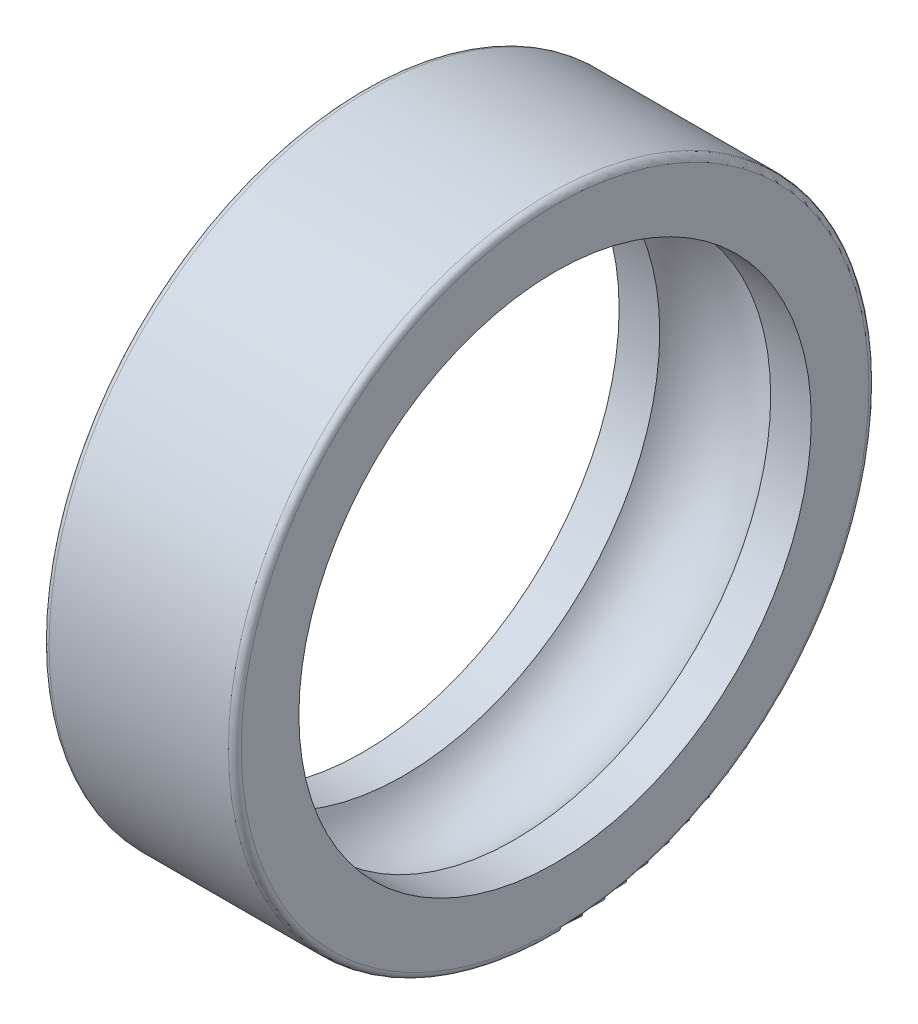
ISO-10303-21;
HEADER;
FILE_DESCRIPTION(('STEP AP214'),'2;1');
FILE_NAME('part.step','',(''),(''),'','','');
FILE_SCHEMA(('AUTOMOTIVE_DESIGN { 1 0 10303 214 1 1 1 1 }'));
ENDSEC;
DATA;
#1=APPLICATION_CONTEXT('core data for automotive mechanical design processes');
#2=APPLICATION_PROTOCOL_DEFINITION('international standard','automotive_design',2000,#1);
#3=PRODUCT_CONTEXT('',#1,'mechanical');
#4=PRODUCT('Part','Part','',(#3));
#5=PRODUCT_RELATED_PRODUCT_CATEGORY('part','',(#4));
#6=PRODUCT_DEFINITION_FORMATION('','',#4);
#7=PRODUCT_DEFINITION_CONTEXT('part definition',#1,'design');
#8=PRODUCT_DEFINITION('design','',#6,#7);
#9=PRODUCT_DEFINITION_SHAPE('','',#8);
#10=(LENGTH_UNIT() NAMED_UNIT(*) SI_UNIT(.MILLI.,.METRE.));
#11=(NAMED_UNIT(*) PLANE_ANGLE_UNIT() SI_UNIT($,.RADIAN.));
#12=(NAMED_UNIT(*) SI_UNIT($,.STERADIAN.) SOLID_ANGLE_UNIT());
#13=UNCERTAINTY_MEASURE_WITH_UNIT(LENGTH_MEASURE(1.E-05),#10,'distance_accuracy_value','');
#14=(GEOMETRIC_REPRESENTATION_CONTEXT(3) GLOBAL_UNCERTAINTY_ASSIGNED_CONTEXT((#13)) GLOBAL_UNIT_ASSIGNED_CONTEXT((#10,
#11,#12)) REPRESENTATION_CONTEXT('',''));
#15=CARTESIAN_POINT('',(0.,0.,0.));
#16=DIRECTION('',(0.,0.,1.));
#17=DIRECTION('',(1.,0.,0.));
#18=AXIS2_PLACEMENT_3D('',#15,#16,#17);
#19=CARTESIAN_POINT('',(-2.99999999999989,7.9999999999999,0.));
#20=DIRECTION('',(-1.,0.,0.));
#21=DIRECTION('',(0.,0.,1.));
#22=AXIS2_PLACEMENT_3D('',#19,#20,#21);
#23=PLANE('',#22);
#24=CARTESIAN_POINT('',(-2.99999999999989,-1.11022302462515E-13,0.));
#25=DIRECTION('',(-1.,0.,0.));
#26=DIRECTION('',(0.,0.,1.));
#27=AXIS2_PLACEMENT_3D('',#24,#25,#26);
#28=CIRCLE('',#27,9.8);
#29=CARTESIAN_POINT('',(-2.99999999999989,-1.11022302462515E-13,9.8));
#30=VERTEX_POINT('',#29);
#31=EDGE_CURVE('E12',#30,#30,#28,.T.);
#32=ORIENTED_EDGE('',*,*,#31,.T.);
#33=EDGE_LOOP('',(#32));
#34=FACE_BOUND('',#33,.T.);
#35=CARTESIAN_POINT('',(-2.99999999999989,-1.11022302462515E-13,0.));
#36=DIRECTION('',(-1.,0.,0.));
#37=DIRECTION('',(0.,0.,1.));
#38=AXIS2_PLACEMENT_3D('',#35,#36,#37);
#39=CIRCLE('',#38,8.);
#40=CARTESIAN_POINT('',(-2.99999999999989,-1.11022302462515E-13,8.));
#41=VERTEX_POINT('',#40);
#42=EDGE_CURVE('E373',#41,#41,#39,.T.);
#43=ORIENTED_EDGE('',*,*,#42,.F.);
#44=EDGE_LOOP('',(#43));
#45=FACE_BOUND('',#44,.T.);
#46=ADVANCED_FACE('F354',(#34,#45),#23,.T.);
#47=CARTESIAN_POINT('',(-6.00000000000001,-1.11022302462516E-13,0.));
#48=DIRECTION('',(-1.,0.,0.));
#49=DIRECTION('',(0.,0.,1.));
#50=AXIS2_PLACEMENT_3D('',#47,#48,#49);
#51=CYLINDRICAL_SURFACE('',#50,8.);
#52=CARTESIAN_POINT('',(-1.73205080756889,0.,0.));
#53=DIRECTION('',(-1.,0.,0.));
#54=DIRECTION('',(0.,0.,1.));
#55=AXIS2_PLACEMENT_3D('',#52,#53,#54);
#56=CIRCLE('',#55,8.);
#57=CARTESIAN_POINT('',(-1.73205080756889,0.,8.));
#58=VERTEX_POINT('',#57);
#59=EDGE_CURVE('E376',#58,#58,#56,.T.);
#60=ORIENTED_EDGE('',*,*,#59,.F.);
#61=EDGE_LOOP('',(#60));
#62=FACE_BOUND('',#61,.T.);
#63=ORIENTED_EDGE('',*,*,#42,.T.);
#64=EDGE_LOOP('',(#63));
#65=FACE_BOUND('',#64,.T.);
#66=ADVANCED_FACE('F396',(#62,#65),#51,.F.);
#67=CARTESIAN_POINT('',(0.,0.,0.));
#68=DIRECTION('',(-1.,0.,0.));
#69=DIRECTION('',(0.,0.,1.));
#70=AXIS2_PLACEMENT_3D('',#67,#68,#69);
#71=TOROIDAL_SURFACE('',#70,7.,2.);
#72=ORIENTED_EDGE('',*,*,#59,.T.);
#73=EDGE_LOOP('',(#72));
#74=FACE_BOUND('',#73,.T.);
#75=CARTESIAN_POINT('',(1.73205080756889,0.,0.));
#76=DIRECTION('',(-1.,0.,0.));
#77=DIRECTION('',(0.,0.,1.));
#78=AXIS2_PLACEMENT_3D('',#75,#76,#77);
#79=CIRCLE('',#78,8.);
#80=CARTESIAN_POINT('',(1.73205080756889,0.,8.));
#81=VERTEX_POINT('',#80);
#82=EDGE_CURVE('E379',#81,#81,#79,.T.);
#83=ORIENTED_EDGE('',*,*,#82,.F.);
#84=EDGE_LOOP('',(#83));
#85=FACE_BOUND('',#84,.T.);
#86=ADVANCED_FACE('F391',(#74,#85),#71,.F.);
#87=CARTESIAN_POINT('',(-6.00000000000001,-1.11022302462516E-13,0.));
#88=DIRECTION('',(-1.,0.,0.));
#89=DIRECTION('',(0.,0.,1.));
#90=AXIS2_PLACEMENT_3D('',#87,#88,#89);
#91=CYLINDRICAL_SURFACE('',#90,8.);
#92=CARTESIAN_POINT('',(2.99999999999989,0.,0.));
#93=DIRECTION('',(-1.,0.,0.));
#94=DIRECTION('',(0.,0.,1.));
#95=AXIS2_PLACEMENT_3D('',#92,#93,#94);
#96=CIRCLE('',#95,8.);
#97=CARTESIAN_POINT('',(2.99999999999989,0.,8.));
#98=VERTEX_POINT('',#97);
#99=EDGE_CURVE('E382',#98,#98,#96,.T.);
#100=ORIENTED_EDGE('',*,*,#99,.F.);
#101=EDGE_LOOP('',(#100));
#102=FACE_BOUND('',#101,.T.);
#103=ORIENTED_EDGE('',*,*,#82,.T.);
#104=EDGE_LOOP('',(#103));
#105=FACE_BOUND('',#104,.T.);
#106=ADVANCED_FACE('F388',(#102,#105),#91,.F.);
#107=CARTESIAN_POINT('',(3.00000000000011,10.,0.));
#108=DIRECTION('',(1.,0.,0.));
#109=DIRECTION('',(0.,0.,-1.));
#110=AXIS2_PLACEMENT_3D('',#107,#108,#109);
#111=PLANE('',#110);
#112=CARTESIAN_POINT('',(2.99999999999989,0.,0.));
#113=DIRECTION('',(1.,0.,0.));
#114=DIRECTION('',(0.,0.,-1.));
#115=AXIS2_PLACEMENT_3D('',#112,#113,#114);
#116=CIRCLE('',#115,9.8);
#117=CARTESIAN_POINT('',(2.99999999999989,0.,-9.8));
#118=VERTEX_POINT('',#117);
#119=EDGE_CURVE('E360',#118,#118,#116,.T.);
#120=ORIENTED_EDGE('',*,*,#119,.T.);
#121=EDGE_LOOP('',(#120));
#122=FACE_BOUND('',#121,.T.);
#123=ORIENTED_EDGE('',*,*,#99,.T.);
#124=EDGE_LOOP('',(#123));
#125=FACE_BOUND('',#124,.T.);
#126=ADVANCED_FACE('F386',(#122,#125),#111,.T.);
#127=CARTESIAN_POINT('',(-6.00000000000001,-1.11022302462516E-13,0.));
#128=DIRECTION('',(-1.,0.,0.));
#129=DIRECTION('',(0.,0.,1.));
#130=AXIS2_PLACEMENT_3D('',#127,#128,#129);
#131=CYLINDRICAL_SURFACE('',#130,10.);
#132=CARTESIAN_POINT('',(2.79999999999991,0.,0.));
#133=DIRECTION('',(1.,0.,0.));
#134=DIRECTION('',(0.,0.,-1.));
#135=AXIS2_PLACEMENT_3D('',#132,#133,#134);
#136=CIRCLE('',#135,10.);
#137=CARTESIAN_POINT('',(2.79999999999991,0.,-10.));
#138=VERTEX_POINT('',#137);
#139=EDGE_CURVE('E364',#138,#138,#136,.F.);
#140=ORIENTED_EDGE('',*,*,#139,.T.);
#141=EDGE_LOOP('',(#140));
#142=FACE_BOUND('',#141,.T.);
#143=CARTESIAN_POINT('',(-2.79999999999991,-1.11022302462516E-13,0.));
#144=DIRECTION('',(-1.,0.,0.));
#145=DIRECTION('',(0.,0.,1.));
#146=AXIS2_PLACEMENT_3D('',#143,#144,#145);
#147=CIRCLE('',#146,10.);
#148=CARTESIAN_POINT('',(-2.79999999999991,-1.11022302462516E-13,10.));
#149=VERTEX_POINT('',#148);
#150=EDGE_CURVE('E368',#149,#149,#147,.F.);
#151=ORIENTED_EDGE('',*,*,#150,.T.);
#152=EDGE_LOOP('',(#151));
#153=FACE_BOUND('',#152,.T.);
#154=ADVANCED_FACE('F418',(#142,#153),#131,.T.);
#155=CARTESIAN_POINT('',(2.79999999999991,0.,0.));
#156=DIRECTION('',(1.,0.,0.));
#157=DIRECTION('',(0.,0.,-1.));
#158=AXIS2_PLACEMENT_3D('',#155,#156,#157);
#159=TOROIDAL_SURFACE('',#158,9.8,0.2);
#160=ORIENTED_EDGE('',*,*,#119,.F.);
#161=EDGE_LOOP('',(#160));
#162=FACE_BOUND('',#161,.T.);
#163=ORIENTED_EDGE('',*,*,#139,.F.);
#164=EDGE_LOOP('',(#163));
#165=FACE_BOUND('',#164,.T.);
#166=ADVANCED_FACE('F422',(#162,#165),#159,.T.);
#167=CARTESIAN_POINT('',(-2.79999999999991,-1.11022302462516E-13,0.));
#168=DIRECTION('',(-1.,0.,0.));
#169=DIRECTION('',(0.,0.,1.));
#170=AXIS2_PLACEMENT_3D('',#167,#168,#169);
#171=TOROIDAL_SURFACE('',#170,9.8,0.2);
#172=ORIENTED_EDGE('',*,*,#150,.F.);
#173=EDGE_LOOP('',(#172));
#174=FACE_BOUND('',#173,.T.);
#175=ORIENTED_EDGE('',*,*,#31,.F.);
#176=EDGE_LOOP('',(#175));
#177=FACE_BOUND('',#176,.T.);
#178=ADVANCED_FACE('F425',(#174,#177),#171,.T.);
#179=CLOSED_SHELL('',(#46,#66,#86,#106,#126,#154,#166,#178));
#180=MANIFOLD_SOLID_BREP('B2',#179);
#181=ADVANCED_BREP_SHAPE_REPRESENTATION('',(#18,#180),#14);
#182=SHAPE_DEFINITION_REPRESENTATION(#9,#181);
ENDSEC;
END-ISO-10303-21;
